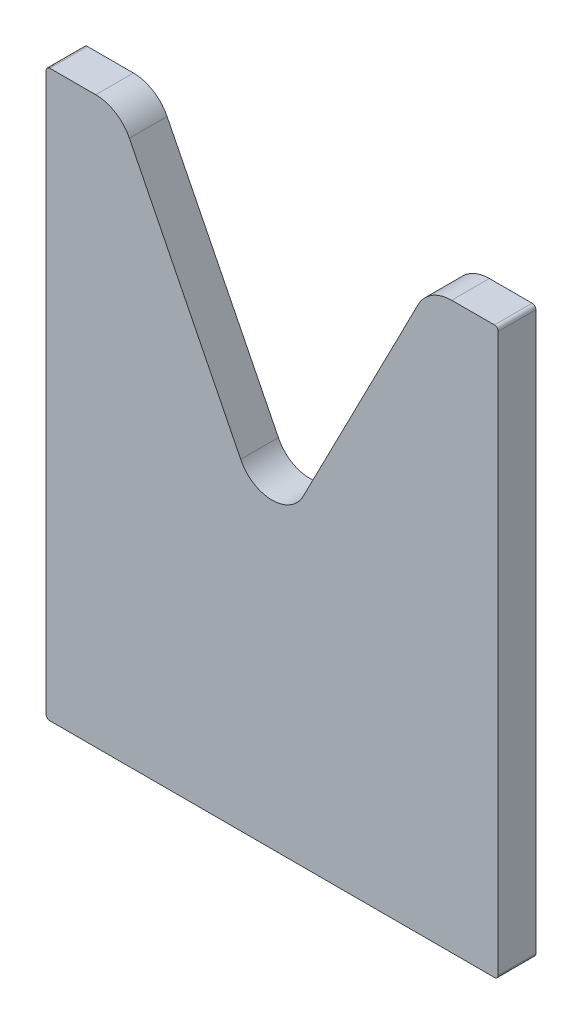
ISO-10303-21;
HEADER;
FILE_DESCRIPTION(('STEP AP214'),'2;1');
FILE_NAME('part.step','',(''),(''),'','','');
FILE_SCHEMA(('AUTOMOTIVE_DESIGN { 1 0 10303 214 1 1 1 1 }'));
ENDSEC;
DATA;
#1=APPLICATION_CONTEXT('core data for automotive mechanical design processes');
#2=APPLICATION_PROTOCOL_DEFINITION('international standard','automotive_design',2000,#1);
#3=PRODUCT_CONTEXT('',#1,'mechanical');
#4=PRODUCT('Part','Part','',(#3));
#5=PRODUCT_RELATED_PRODUCT_CATEGORY('part','',(#4));
#6=PRODUCT_DEFINITION_FORMATION('','',#4);
#7=PRODUCT_DEFINITION_CONTEXT('part definition',#1,'design');
#8=PRODUCT_DEFINITION('design','',#6,#7);
#9=PRODUCT_DEFINITION_SHAPE('','',#8);
#10=(LENGTH_UNIT() NAMED_UNIT(*) SI_UNIT(.MILLI.,.METRE.));
#11=(NAMED_UNIT(*) PLANE_ANGLE_UNIT() SI_UNIT($,.RADIAN.));
#12=(NAMED_UNIT(*) SI_UNIT($,.STERADIAN.) SOLID_ANGLE_UNIT());
#13=UNCERTAINTY_MEASURE_WITH_UNIT(LENGTH_MEASURE(1.E-05),#10,'distance_accuracy_value','');
#14=(GEOMETRIC_REPRESENTATION_CONTEXT(3) GLOBAL_UNCERTAINTY_ASSIGNED_CONTEXT((#13)) GLOBAL_UNIT_ASSIGNED_CONTEXT((#10,
#11,#12)) REPRESENTATION_CONTEXT('',''));
#15=CARTESIAN_POINT('',(0.,0.,0.));
#16=DIRECTION('',(0.,0.,1.));
#17=DIRECTION('',(1.,0.,0.));
#18=AXIS2_PLACEMENT_3D('',#15,#16,#17);
#19=CARTESIAN_POINT('',(0.,14.5,-10.));
#20=DIRECTION('',(0.,0.,1.));
#21=DIRECTION('',(1.,0.,0.));
#22=AXIS2_PLACEMENT_3D('',#19,#20,#21);
#23=CYLINDRICAL_SURFACE('',#22,9.28468222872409);
#24=CARTESIAN_POINT('',(0.,14.5,0.));
#25=DIRECTION('',(0.,0.,-1.));
#26=DIRECTION('',(1.,0.,0.));
#27=AXIS2_PLACEMENT_3D('',#24,#25,#26);
#28=CIRCLE('',#27,9.28468222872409);
#29=CARTESIAN_POINT('',(8.3467742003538,10.4334677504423,0.));
#30=VERTEX_POINT('',#29);
#31=CARTESIAN_POINT('',(-8.3467742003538,10.4334677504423,0.));
#32=VERTEX_POINT('',#31);
#33=EDGE_CURVE('E173',#30,#32,#28,.T.);
#34=ORIENTED_EDGE('',*,*,#33,.F.);
#35=DIRECTION('',(0.,0.,1.));
#36=VECTOR('',#35,1.);
#37=CARTESIAN_POINT('',(8.3467742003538,10.4334677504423,-10.));
#38=LINE('',#37,#36);
#39=CARTESIAN_POINT('',(8.3467742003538,10.4334677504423,-10.));
#40=VERTEX_POINT('',#39);
#41=EDGE_CURVE('E11',#40,#30,#38,.T.);
#42=ORIENTED_EDGE('',*,*,#41,.F.);
#43=CARTESIAN_POINT('',(0.,14.5,-10.));
#44=DIRECTION('',(0.,0.,-1.));
#45=DIRECTION('',(1.,0.,0.));
#46=AXIS2_PLACEMENT_3D('',#43,#44,#45);
#47=CIRCLE('',#46,9.28468222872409);
#48=CARTESIAN_POINT('',(-8.3467742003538,10.4334677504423,-10.));
#49=VERTEX_POINT('',#48);
#50=EDGE_CURVE('E211',#40,#49,#47,.T.);
#51=ORIENTED_EDGE('',*,*,#50,.T.);
#52=DIRECTION('',(0.,0.,1.));
#53=VECTOR('',#52,1.);
#54=CARTESIAN_POINT('',(-8.3467742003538,10.4334677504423,-10.));
#55=LINE('',#54,#53);
#56=EDGE_CURVE('E43',#49,#32,#55,.T.);
#57=ORIENTED_EDGE('',*,*,#56,.T.);
#58=EDGE_LOOP('',(#34,#42,#51,#57));
#59=FACE_BOUND('',#58,.T.);
#60=ADVANCED_FACE('F40',(#59),#23,.F.);
#61=CARTESIAN_POINT('',(8.3467742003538,10.4334677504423,-10.));
#62=DIRECTION('',(-0.889315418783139,0.457294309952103,0.));
#63=DIRECTION('',(-0.457294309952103,-0.889315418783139,0.));
#64=AXIS2_PLACEMENT_3D('',#61,#62,#63);
#65=PLANE('',#64);
#66=DIRECTION('',(-0.457294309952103,-0.889315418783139,0.));
#67=VECTOR('',#66,1.);
#68=CARTESIAN_POINT('',(8.3467742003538,10.4334677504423,0.));
#69=LINE('',#68,#67);
#70=CARTESIAN_POINT('',(38.7568458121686,69.572943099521,0.));
#71=VERTEX_POINT('',#70);
#72=EDGE_CURVE('E209',#71,#30,#69,.T.);
#73=ORIENTED_EDGE('',*,*,#72,.F.);
#74=DIRECTION('',(0.,0.,1.));
#75=VECTOR('',#74,1.);
#76=CARTESIAN_POINT('',(38.7568458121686,69.572943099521,-10.));
#77=LINE('',#76,#75);
#78=CARTESIAN_POINT('',(38.7568458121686,69.572943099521,-10.));
#79=VERTEX_POINT('',#78);
#80=EDGE_CURVE('E49',#79,#71,#77,.T.);
#81=ORIENTED_EDGE('',*,*,#80,.F.);
#82=DIRECTION('',(-0.457294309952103,-0.889315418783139,0.));
#83=VECTOR('',#82,1.);
#84=CARTESIAN_POINT('',(8.3467742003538,10.4334677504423,-10.));
#85=LINE('',#84,#83);
#86=EDGE_CURVE('E163',#79,#40,#85,.T.);
#87=ORIENTED_EDGE('',*,*,#86,.T.);
#88=ORIENTED_EDGE('',*,*,#41,.T.);
#89=EDGE_LOOP('',(#73,#81,#87,#88));
#90=FACE_BOUND('',#89,.T.);
#91=ADVANCED_FACE('F235',(#90),#65,.T.);
#92=CARTESIAN_POINT('',(47.65,65.,-10.));
#93=DIRECTION('',(0.,0.,1.));
#94=DIRECTION('',(1.,0.,0.));
#95=AXIS2_PLACEMENT_3D('',#92,#93,#94);
#96=CYLINDRICAL_SURFACE('',#95,10.);
#97=CARTESIAN_POINT('',(47.65,65.,0.));
#98=DIRECTION('',(0.,0.,1.));
#99=DIRECTION('',(1.,0.,0.));
#100=AXIS2_PLACEMENT_3D('',#97,#98,#99);
#101=CIRCLE('',#100,10.);
#102=CARTESIAN_POINT('',(47.65,75.,0.));
#103=VERTEX_POINT('',#102);
#104=EDGE_CURVE('E150',#103,#71,#101,.T.);
#105=ORIENTED_EDGE('',*,*,#104,.F.);
#106=DIRECTION('',(0.,0.,1.));
#107=VECTOR('',#106,1.);
#108=CARTESIAN_POINT('',(47.65,75.,-10.));
#109=LINE('',#108,#107);
#110=CARTESIAN_POINT('',(47.65,75.,-10.));
#111=VERTEX_POINT('',#110);
#112=EDGE_CURVE('E145',#111,#103,#109,.T.);
#113=ORIENTED_EDGE('',*,*,#112,.F.);
#114=CARTESIAN_POINT('',(47.65,65.,-10.));
#115=DIRECTION('',(0.,0.,1.));
#116=DIRECTION('',(1.,0.,0.));
#117=AXIS2_PLACEMENT_3D('',#114,#115,#116);
#118=CIRCLE('',#117,10.);
#119=EDGE_CURVE('E148',#111,#79,#118,.T.);
#120=ORIENTED_EDGE('',*,*,#119,.T.);
#121=ORIENTED_EDGE('',*,*,#80,.T.);
#122=EDGE_LOOP('',(#105,#113,#120,#121));
#123=FACE_BOUND('',#122,.T.);
#124=ADVANCED_FACE('F147',(#123),#96,.T.);
#125=CARTESIAN_POINT('',(59.,75.,-10.));
#126=DIRECTION('',(0.,1.,0.));
#127=DIRECTION('',(0.,0.,1.));
#128=AXIS2_PLACEMENT_3D('',#125,#126,#127);
#129=PLANE('',#128);
#130=DIRECTION('',(-1.,0.,0.));
#131=VECTOR('',#130,1.);
#132=CARTESIAN_POINT('',(59.,75.,0.));
#133=LINE('',#132,#131);
#134=CARTESIAN_POINT('',(59.,75.,0.));
#135=VERTEX_POINT('',#134);
#136=EDGE_CURVE('E206',#135,#103,#133,.T.);
#137=ORIENTED_EDGE('',*,*,#136,.F.);
#138=DIRECTION('',(0.,0.,1.));
#139=VECTOR('',#138,1.);
#140=CARTESIAN_POINT('',(59.,75.,-10.));
#141=LINE('',#140,#139);
#142=CARTESIAN_POINT('',(59.,75.,-10.));
#143=VERTEX_POINT('',#142);
#144=EDGE_CURVE('E155',#143,#135,#141,.T.);
#145=ORIENTED_EDGE('',*,*,#144,.F.);
#146=DIRECTION('',(-1.,0.,0.));
#147=VECTOR('',#146,1.);
#148=CARTESIAN_POINT('',(59.,75.,-10.));
#149=LINE('',#148,#147);
#150=EDGE_CURVE('E161',#143,#111,#149,.T.);
#151=ORIENTED_EDGE('',*,*,#150,.T.);
#152=ORIENTED_EDGE('',*,*,#112,.T.);
#153=EDGE_LOOP('',(#137,#145,#151,#152));
#154=FACE_BOUND('',#153,.T.);
#155=ADVANCED_FACE('F165',(#154),#129,.T.);
#156=CARTESIAN_POINT('',(59.,74.,-10.));
#157=DIRECTION('',(0.,0.,1.));
#158=DIRECTION('',(1.,0.,0.));
#159=AXIS2_PLACEMENT_3D('',#156,#157,#158);
#160=CYLINDRICAL_SURFACE('',#159,1.00000000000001);
#161=CARTESIAN_POINT('',(59.,74.,0.));
#162=DIRECTION('',(0.,0.,1.));
#163=DIRECTION('',(-1.,0.,0.));
#164=AXIS2_PLACEMENT_3D('',#161,#162,#163);
#165=CIRCLE('',#164,1.00000000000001);
#166=CARTESIAN_POINT('',(60.,74.,0.));
#167=VERTEX_POINT('',#166);
#168=EDGE_CURVE('E203',#167,#135,#165,.T.);
#169=ORIENTED_EDGE('',*,*,#168,.F.);
#170=DIRECTION('',(0.,0.,1.));
#171=VECTOR('',#170,1.);
#172=CARTESIAN_POINT('',(60.,74.,-10.));
#173=LINE('',#172,#171);
#174=CARTESIAN_POINT('',(60.,74.,-10.));
#175=VERTEX_POINT('',#174);
#176=EDGE_CURVE('E215',#175,#167,#173,.T.);
#177=ORIENTED_EDGE('',*,*,#176,.F.);
#178=CARTESIAN_POINT('',(59.,74.,-10.));
#179=DIRECTION('',(0.,0.,1.));
#180=DIRECTION('',(-1.,0.,0.));
#181=AXIS2_PLACEMENT_3D('',#178,#179,#180);
#182=CIRCLE('',#181,1.00000000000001);
#183=EDGE_CURVE('E166',#175,#143,#182,.T.);
#184=ORIENTED_EDGE('',*,*,#183,.T.);
#185=ORIENTED_EDGE('',*,*,#144,.T.);
#186=EDGE_LOOP('',(#169,#177,#184,#185));
#187=FACE_BOUND('',#186,.T.);
#188=ADVANCED_FACE('F248',(#187),#160,.T.);
#189=CARTESIAN_POINT('',(60.,74.,-10.));
#190=DIRECTION('',(1.,0.,0.));
#191=DIRECTION('',(0.,1.,0.));
#192=AXIS2_PLACEMENT_3D('',#189,#190,#191);
#193=PLANE('',#192);
#194=DIRECTION('',(0.,1.,0.));
#195=VECTOR('',#194,1.);
#196=CARTESIAN_POINT('',(60.,74.,0.));
#197=LINE('',#196,#195);
#198=CARTESIAN_POINT('',(60.,-74.,0.));
#199=VERTEX_POINT('',#198);
#200=EDGE_CURVE('E200',#199,#167,#197,.T.);
#201=ORIENTED_EDGE('',*,*,#200,.F.);
#202=DIRECTION('',(0.,0.,1.));
#203=VECTOR('',#202,1.);
#204=CARTESIAN_POINT('',(60.,-74.,-10.));
#205=LINE('',#204,#203);
#206=CARTESIAN_POINT('',(60.,-74.,-10.));
#207=VERTEX_POINT('',#206);
#208=EDGE_CURVE('E217',#207,#199,#205,.T.);
#209=ORIENTED_EDGE('',*,*,#208,.F.);
#210=DIRECTION('',(0.,1.,0.));
#211=VECTOR('',#210,1.);
#212=CARTESIAN_POINT('',(60.,74.,-10.));
#213=LINE('',#212,#211);
#214=EDGE_CURVE('E168',#207,#175,#213,.T.);
#215=ORIENTED_EDGE('',*,*,#214,.T.);
#216=ORIENTED_EDGE('',*,*,#176,.T.);
#217=EDGE_LOOP('',(#201,#209,#215,#216));
#218=FACE_BOUND('',#217,.T.);
#219=ADVANCED_FACE('F251',(#218),#193,.T.);
#220=CARTESIAN_POINT('',(59.,-74.,-10.));
#221=DIRECTION('',(0.,0.,1.));
#222=DIRECTION('',(1.,0.,0.));
#223=AXIS2_PLACEMENT_3D('',#220,#221,#222);
#224=CYLINDRICAL_SURFACE('',#223,0.999999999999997);
#225=CARTESIAN_POINT('',(59.,-74.,0.));
#226=DIRECTION('',(0.,0.,1.));
#227=DIRECTION('',(-1.,0.,0.));
#228=AXIS2_PLACEMENT_3D('',#225,#226,#227);
#229=CIRCLE('',#228,0.999999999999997);
#230=CARTESIAN_POINT('',(59.,-75.,0.));
#231=VERTEX_POINT('',#230);
#232=EDGE_CURVE('E197',#231,#199,#229,.T.);
#233=ORIENTED_EDGE('',*,*,#232,.F.);
#234=DIRECTION('',(0.,0.,1.));
#235=VECTOR('',#234,1.);
#236=CARTESIAN_POINT('',(59.,-75.,-10.));
#237=LINE('',#236,#235);
#238=CARTESIAN_POINT('',(59.,-75.,-10.));
#239=VERTEX_POINT('',#238);
#240=EDGE_CURVE('E219',#239,#231,#237,.T.);
#241=ORIENTED_EDGE('',*,*,#240,.F.);
#242=CARTESIAN_POINT('',(59.,-74.,-10.));
#243=DIRECTION('',(0.,0.,1.));
#244=DIRECTION('',(-1.,0.,0.));
#245=AXIS2_PLACEMENT_3D('',#242,#243,#244);
#246=CIRCLE('',#245,0.999999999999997);
#247=EDGE_CURVE('E440',#239,#207,#246,.T.);
#248=ORIENTED_EDGE('',*,*,#247,.T.);
#249=ORIENTED_EDGE('',*,*,#208,.T.);
#250=EDGE_LOOP('',(#233,#241,#248,#249));
#251=FACE_BOUND('',#250,.T.);
#252=ADVANCED_FACE('F255',(#251),#224,.T.);
#253=CARTESIAN_POINT('',(-59.,-75.,-10.));
#254=DIRECTION('',(0.,-1.,0.));
#255=DIRECTION('',(0.,0.,-1.));
#256=AXIS2_PLACEMENT_3D('',#253,#254,#255);
#257=PLANE('',#256);
#258=DIRECTION('',(1.,0.,0.));
#259=VECTOR('',#258,1.);
#260=CARTESIAN_POINT('',(-59.,-75.,0.));
#261=LINE('',#260,#259);
#262=CARTESIAN_POINT('',(-59.,-75.,0.));
#263=VERTEX_POINT('',#262);
#264=EDGE_CURVE('E194',#263,#231,#261,.T.);
#265=ORIENTED_EDGE('',*,*,#264,.F.);
#266=DIRECTION('',(0.,0.,1.));
#267=VECTOR('',#266,1.);
#268=CARTESIAN_POINT('',(-59.,-75.,-10.));
#269=LINE('',#268,#267);
#270=CARTESIAN_POINT('',(-59.,-75.,-10.));
#271=VERTEX_POINT('',#270);
#272=EDGE_CURVE('E221',#271,#263,#269,.T.);
#273=ORIENTED_EDGE('',*,*,#272,.F.);
#274=DIRECTION('',(1.,0.,0.));
#275=VECTOR('',#274,1.);
#276=CARTESIAN_POINT('',(-59.,-75.,-10.));
#277=LINE('',#276,#275);
#278=EDGE_CURVE('E433',#271,#239,#277,.T.);
#279=ORIENTED_EDGE('',*,*,#278,.T.);
#280=ORIENTED_EDGE('',*,*,#240,.T.);
#281=EDGE_LOOP('',(#265,#273,#279,#280));
#282=FACE_BOUND('',#281,.T.);
#283=ADVANCED_FACE('F259',(#282),#257,.T.);
#284=CARTESIAN_POINT('',(-59.,-74.,-10.));
#285=DIRECTION('',(0.,0.,1.));
#286=DIRECTION('',(1.,0.,0.));
#287=AXIS2_PLACEMENT_3D('',#284,#285,#286);
#288=CYLINDRICAL_SURFACE('',#287,0.999999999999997);
#289=CARTESIAN_POINT('',(-59.,-74.,0.));
#290=DIRECTION('',(0.,0.,1.));
#291=DIRECTION('',(-1.,0.,0.));
#292=AXIS2_PLACEMENT_3D('',#289,#290,#291);
#293=CIRCLE('',#292,0.999999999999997);
#294=CARTESIAN_POINT('',(-60.,-74.,0.));
#295=VERTEX_POINT('',#294);
#296=EDGE_CURVE('E191',#295,#263,#293,.T.);
#297=ORIENTED_EDGE('',*,*,#296,.F.);
#298=DIRECTION('',(0.,0.,1.));
#299=VECTOR('',#298,1.);
#300=CARTESIAN_POINT('',(-60.,-74.,-10.));
#301=LINE('',#300,#299);
#302=CARTESIAN_POINT('',(-60.,-74.,-10.));
#303=VERTEX_POINT('',#302);
#304=EDGE_CURVE('E223',#303,#295,#301,.T.);
#305=ORIENTED_EDGE('',*,*,#304,.F.);
#306=CARTESIAN_POINT('',(-59.,-74.,-10.));
#307=DIRECTION('',(0.,0.,1.));
#308=DIRECTION('',(-1.,0.,0.));
#309=AXIS2_PLACEMENT_3D('',#306,#307,#308);
#310=CIRCLE('',#309,0.999999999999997);
#311=EDGE_CURVE('E429',#303,#271,#310,.T.);
#312=ORIENTED_EDGE('',*,*,#311,.T.);
#313=ORIENTED_EDGE('',*,*,#272,.T.);
#314=EDGE_LOOP('',(#297,#305,#312,#313));
#315=FACE_BOUND('',#314,.T.);
#316=ADVANCED_FACE('F263',(#315),#288,.T.);
#317=CARTESIAN_POINT('',(-60.,74.,-10.));
#318=DIRECTION('',(-1.,0.,0.));
#319=DIRECTION('',(0.,-1.,0.));
#320=AXIS2_PLACEMENT_3D('',#317,#318,#319);
#321=PLANE('',#320);
#322=DIRECTION('',(0.,-1.,0.));
#323=VECTOR('',#322,1.);
#324=CARTESIAN_POINT('',(-60.,74.,0.));
#325=LINE('',#324,#323);
#326=CARTESIAN_POINT('',(-60.,74.,0.));
#327=VERTEX_POINT('',#326);
#328=EDGE_CURVE('E188',#327,#295,#325,.T.);
#329=ORIENTED_EDGE('',*,*,#328,.F.);
#330=DIRECTION('',(0.,0.,1.));
#331=VECTOR('',#330,1.);
#332=CARTESIAN_POINT('',(-60.,74.,-10.));
#333=LINE('',#332,#331);
#334=CARTESIAN_POINT('',(-60.,74.,-10.));
#335=VERTEX_POINT('',#334);
#336=EDGE_CURVE('E225',#335,#327,#333,.T.);
#337=ORIENTED_EDGE('',*,*,#336,.F.);
#338=DIRECTION('',(0.,-1.,0.));
#339=VECTOR('',#338,1.);
#340=CARTESIAN_POINT('',(-60.,74.,-10.));
#341=LINE('',#340,#339);
#342=EDGE_CURVE('E445',#335,#303,#341,.T.);
#343=ORIENTED_EDGE('',*,*,#342,.T.);
#344=ORIENTED_EDGE('',*,*,#304,.T.);
#345=EDGE_LOOP('',(#329,#337,#343,#344));
#346=FACE_BOUND('',#345,.T.);
#347=ADVANCED_FACE('F267',(#346),#321,.T.);
#348=CARTESIAN_POINT('',(-59.,74.,-10.));
#349=DIRECTION('',(0.,0.,1.));
#350=DIRECTION('',(1.,0.,0.));
#351=AXIS2_PLACEMENT_3D('',#348,#349,#350);
#352=CYLINDRICAL_SURFACE('',#351,1.);
#353=CARTESIAN_POINT('',(-59.,74.,0.));
#354=DIRECTION('',(0.,0.,1.));
#355=DIRECTION('',(-1.,0.,0.));
#356=AXIS2_PLACEMENT_3D('',#353,#354,#355);
#357=CIRCLE('',#356,1.);
#358=CARTESIAN_POINT('',(-59.,75.,0.));
#359=VERTEX_POINT('',#358);
#360=EDGE_CURVE('E185',#359,#327,#357,.T.);
#361=ORIENTED_EDGE('',*,*,#360,.F.);
#362=DIRECTION('',(0.,0.,1.));
#363=VECTOR('',#362,1.);
#364=CARTESIAN_POINT('',(-59.,75.,-10.));
#365=LINE('',#364,#363);
#366=CARTESIAN_POINT('',(-59.,75.,-10.));
#367=VERTEX_POINT('',#366);
#368=EDGE_CURVE('E227',#367,#359,#365,.T.);
#369=ORIENTED_EDGE('',*,*,#368,.F.);
#370=CARTESIAN_POINT('',(-59.,74.,-10.));
#371=DIRECTION('',(0.,0.,1.));
#372=DIRECTION('',(-1.,0.,0.));
#373=AXIS2_PLACEMENT_3D('',#370,#371,#372);
#374=CIRCLE('',#373,1.);
#375=EDGE_CURVE('E422',#367,#335,#374,.T.);
#376=ORIENTED_EDGE('',*,*,#375,.T.);
#377=ORIENTED_EDGE('',*,*,#336,.T.);
#378=EDGE_LOOP('',(#361,#369,#376,#377));
#379=FACE_BOUND('',#378,.T.);
#380=ADVANCED_FACE('F271',(#379),#352,.T.);
#381=CARTESIAN_POINT('',(-59.,75.,-10.));
#382=DIRECTION('',(0.,1.,0.));
#383=DIRECTION('',(0.,0.,1.));
#384=AXIS2_PLACEMENT_3D('',#381,#382,#383);
#385=PLANE('',#384);
#386=DIRECTION('',(-1.,0.,0.));
#387=VECTOR('',#386,1.);
#388=CARTESIAN_POINT('',(-59.,75.,0.));
#389=LINE('',#388,#387);
#390=CARTESIAN_POINT('',(-46.83,75.,0.));
#391=VERTEX_POINT('',#390);
#392=EDGE_CURVE('E182',#391,#359,#389,.T.);
#393=ORIENTED_EDGE('',*,*,#392,.F.);
#394=DIRECTION('',(0.,0.,1.));
#395=VECTOR('',#394,1.);
#396=CARTESIAN_POINT('',(-46.83,75.,-10.));
#397=LINE('',#396,#395);
#398=CARTESIAN_POINT('',(-46.83,75.,-10.));
#399=VERTEX_POINT('',#398);
#400=EDGE_CURVE('E229',#399,#391,#397,.T.);
#401=ORIENTED_EDGE('',*,*,#400,.F.);
#402=DIRECTION('',(-1.,0.,0.));
#403=VECTOR('',#402,1.);
#404=CARTESIAN_POINT('',(-59.,75.,-10.));
#405=LINE('',#404,#403);
#406=EDGE_CURVE('E418',#399,#367,#405,.T.);
#407=ORIENTED_EDGE('',*,*,#406,.T.);
#408=ORIENTED_EDGE('',*,*,#368,.T.);
#409=EDGE_LOOP('',(#393,#401,#407,#408));
#410=FACE_BOUND('',#409,.T.);
#411=ADVANCED_FACE('F275',(#410),#385,.T.);
#412=CARTESIAN_POINT('',(-46.83,65.,-10.));
#413=DIRECTION('',(0.,0.,1.));
#414=DIRECTION('',(1.,0.,0.));
#415=AXIS2_PLACEMENT_3D('',#412,#413,#414);
#416=CYLINDRICAL_SURFACE('',#415,10.);
#417=CARTESIAN_POINT('',(-46.83,65.,0.));
#418=DIRECTION('',(0.,0.,1.));
#419=DIRECTION('',(1.,0.,0.));
#420=AXIS2_PLACEMENT_3D('',#417,#418,#419);
#421=CIRCLE('',#420,10.);
#422=CARTESIAN_POINT('',(-37.8869171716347,69.4745133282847,0.));
#423=VERTEX_POINT('',#422);
#424=EDGE_CURVE('E179',#423,#391,#421,.T.);
#425=ORIENTED_EDGE('',*,*,#424,.F.);
#426=DIRECTION('',(0.,0.,1.));
#427=VECTOR('',#426,1.);
#428=CARTESIAN_POINT('',(-37.8869171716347,69.4745133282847,-10.));
#429=LINE('',#428,#427);
#430=CARTESIAN_POINT('',(-37.8869171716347,69.4745133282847,-10.));
#431=VERTEX_POINT('',#430);
#432=EDGE_CURVE('E230',#431,#423,#429,.T.);
#433=ORIENTED_EDGE('',*,*,#432,.F.);
#434=CARTESIAN_POINT('',(-46.83,65.,-10.));
#435=DIRECTION('',(0.,0.,1.));
#436=DIRECTION('',(1.,0.,0.));
#437=AXIS2_PLACEMENT_3D('',#434,#435,#436);
#438=CIRCLE('',#437,10.);
#439=EDGE_CURVE('E449',#431,#399,#438,.T.);
#440=ORIENTED_EDGE('',*,*,#439,.T.);
#441=ORIENTED_EDGE('',*,*,#400,.T.);
#442=EDGE_LOOP('',(#425,#433,#440,#441));
#443=FACE_BOUND('',#442,.T.);
#444=ADVANCED_FACE('F279',(#443),#416,.T.);
#445=CARTESIAN_POINT('',(-37.8869171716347,69.4745133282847,-10.));
#446=DIRECTION('',(0.894308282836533,0.447451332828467,0.));
#447=DIRECTION('',(-0.447451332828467,0.894308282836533,0.));
#448=AXIS2_PLACEMENT_3D('',#445,#446,#447);
#449=PLANE('',#448);
#450=DIRECTION('',(-0.447451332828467,0.894308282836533,0.));
#451=VECTOR('',#450,1.);
#452=CARTESIAN_POINT('',(-37.8869171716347,69.4745133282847,0.));
#453=LINE('',#452,#451);
#454=EDGE_CURVE('E176',#32,#423,#453,.T.);
#455=ORIENTED_EDGE('',*,*,#454,.F.);
#456=ORIENTED_EDGE('',*,*,#56,.F.);
#457=DIRECTION('',(-0.447451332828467,0.894308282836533,0.));
#458=VECTOR('',#457,1.);
#459=CARTESIAN_POINT('',(-37.8869171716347,69.4745133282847,-10.));
#460=LINE('',#459,#458);
#461=EDGE_CURVE('E451',#49,#431,#460,.T.);
#462=ORIENTED_EDGE('',*,*,#461,.T.);
#463=ORIENTED_EDGE('',*,*,#432,.T.);
#464=EDGE_LOOP('',(#455,#456,#462,#463));
#465=FACE_BOUND('',#464,.T.);
#466=ADVANCED_FACE('F232',(#465),#449,.T.);
#467=CARTESIAN_POINT('',(0.,14.5,-10.));
#468=DIRECTION('',(0.,0.,1.));
#469=DIRECTION('',(1.,0.,0.));
#470=AXIS2_PLACEMENT_3D('',#467,#468,#469);
#471=PLANE('',#470);
#472=ORIENTED_EDGE('',*,*,#50,.F.);
#473=ORIENTED_EDGE('',*,*,#86,.F.);
#474=ORIENTED_EDGE('',*,*,#119,.F.);
#475=ORIENTED_EDGE('',*,*,#150,.F.);
#476=ORIENTED_EDGE('',*,*,#183,.F.);
#477=ORIENTED_EDGE('',*,*,#214,.F.);
#478=ORIENTED_EDGE('',*,*,#247,.F.);
#479=ORIENTED_EDGE('',*,*,#278,.F.);
#480=ORIENTED_EDGE('',*,*,#311,.F.);
#481=ORIENTED_EDGE('',*,*,#342,.F.);
#482=ORIENTED_EDGE('',*,*,#375,.F.);
#483=ORIENTED_EDGE('',*,*,#406,.F.);
#484=ORIENTED_EDGE('',*,*,#439,.F.);
#485=ORIENTED_EDGE('',*,*,#461,.F.);
#486=EDGE_LOOP('',(#472,#473,#474,#475,#476,#477,#478,#479,#480,#481,#482,#483,#484,#485));
#487=FACE_BOUND('',#486,.T.);
#488=ADVANCED_FACE('F159',(#487),#471,.F.);
#489=CARTESIAN_POINT('',(0.,14.5,0.));
#490=DIRECTION('',(0.,0.,1.));
#491=DIRECTION('',(1.,0.,0.));
#492=AXIS2_PLACEMENT_3D('',#489,#490,#491);
#493=PLANE('',#492);
#494=ORIENTED_EDGE('',*,*,#33,.T.);
#495=ORIENTED_EDGE('',*,*,#454,.T.);
#496=ORIENTED_EDGE('',*,*,#424,.T.);
#497=ORIENTED_EDGE('',*,*,#392,.T.);
#498=ORIENTED_EDGE('',*,*,#360,.T.);
#499=ORIENTED_EDGE('',*,*,#328,.T.);
#500=ORIENTED_EDGE('',*,*,#296,.T.);
#501=ORIENTED_EDGE('',*,*,#264,.T.);
#502=ORIENTED_EDGE('',*,*,#232,.T.);
#503=ORIENTED_EDGE('',*,*,#200,.T.);
#504=ORIENTED_EDGE('',*,*,#168,.T.);
#505=ORIENTED_EDGE('',*,*,#136,.T.);
#506=ORIENTED_EDGE('',*,*,#104,.T.);
#507=ORIENTED_EDGE('',*,*,#72,.T.);
#508=EDGE_LOOP('',(#494,#495,#496,#497,#498,#499,#500,#501,#502,#503,#504,#505,#506,#507));
#509=FACE_BOUND('',#508,.T.);
#510=ADVANCED_FACE('F234',(#509),#493,.T.);
#511=CLOSED_SHELL('',(#60,#91,#124,#155,#188,#219,#252,#283,#316,#347,#380,#411,#444,#466,#488,#510));
#512=MANIFOLD_SOLID_BREP('B2',#511);
#513=ADVANCED_BREP_SHAPE_REPRESENTATION('',(#18,#512),#14);
#514=SHAPE_DEFINITION_REPRESENTATION(#9,#513);
ENDSEC;
END-ISO-10303-21;
